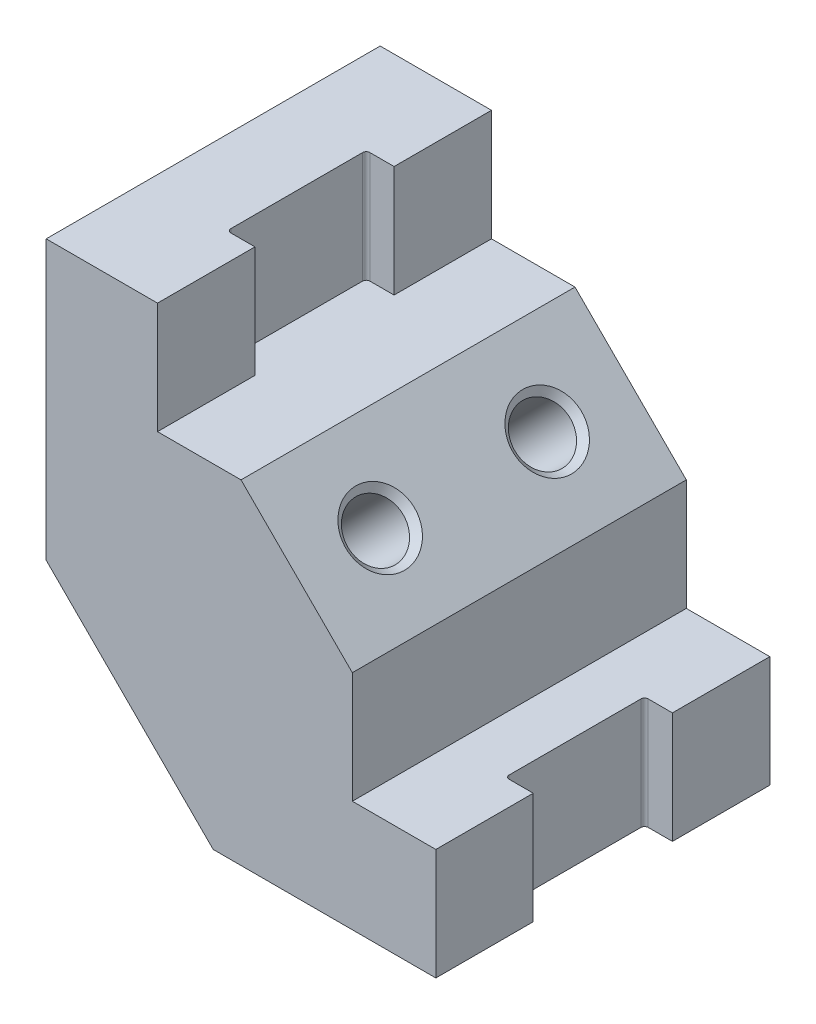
ISO-10303-21;
HEADER;
FILE_DESCRIPTION(('STEP AP214'),'2;1');
FILE_NAME('part.step','',(''),(''),'','','');
FILE_SCHEMA(('AUTOMOTIVE_DESIGN { 1 0 10303 214 1 1 1 1 }'));
ENDSEC;
DATA;
#1=APPLICATION_CONTEXT('core data for automotive mechanical design processes');
#2=APPLICATION_PROTOCOL_DEFINITION('international standard','automotive_design',2000,#1);
#3=PRODUCT_CONTEXT('',#1,'mechanical');
#4=PRODUCT('Part','Part','',(#3));
#5=PRODUCT_RELATED_PRODUCT_CATEGORY('part','',(#4));
#6=PRODUCT_DEFINITION_FORMATION('','',#4);
#7=PRODUCT_DEFINITION_CONTEXT('part definition',#1,'design');
#8=PRODUCT_DEFINITION('design','',#6,#7);
#9=PRODUCT_DEFINITION_SHAPE('','',#8);
#10=(LENGTH_UNIT() NAMED_UNIT(*) SI_UNIT(.MILLI.,.METRE.));
#11=(NAMED_UNIT(*) PLANE_ANGLE_UNIT() SI_UNIT($,.RADIAN.));
#12=(NAMED_UNIT(*) SI_UNIT($,.STERADIAN.) SOLID_ANGLE_UNIT());
#13=UNCERTAINTY_MEASURE_WITH_UNIT(LENGTH_MEASURE(1.E-05),#10,'distance_accuracy_value','');
#14=(GEOMETRIC_REPRESENTATION_CONTEXT(3) GLOBAL_UNCERTAINTY_ASSIGNED_CONTEXT((#13)) GLOBAL_UNIT_ASSIGNED_CONTEXT((#10,
#11,#12)) REPRESENTATION_CONTEXT('',''));
#15=CARTESIAN_POINT('',(0.,0.,0.));
#16=DIRECTION('',(0.,0.,1.));
#17=DIRECTION('',(1.,0.,0.));
#18=AXIS2_PLACEMENT_3D('',#15,#16,#17);
#19=CARTESIAN_POINT('',(88.9,-76.2,38.1));
#20=DIRECTION('',(-1.,0.,0.));
#21=DIRECTION('',(0.,0.,1.));
#22=AXIS2_PLACEMENT_3D('',#19,#20,#21);
#23=PLANE('',#22);
#24=DIRECTION('',(0.,0.,-1.));
#25=VECTOR('',#24,1.);
#26=CARTESIAN_POINT('',(88.9,-101.6,38.1));
#27=LINE('',#26,#25);
#28=CARTESIAN_POINT('',(88.9,-101.6,38.1));
#29=VERTEX_POINT('',#28);
#30=CARTESIAN_POINT('',(88.8999999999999,-101.6,15.875));
#31=VERTEX_POINT('',#30);
#32=EDGE_CURVE('E210',#29,#31,#27,.T.);
#33=ORIENTED_EDGE('',*,*,#32,.T.);
#34=DIRECTION('',(0.,1.,0.));
#35=VECTOR('',#34,1.);
#36=CARTESIAN_POINT('',(88.8999999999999,-101.6,15.875));
#37=LINE('',#36,#35);
#38=CARTESIAN_POINT('',(88.9,-76.2,15.875));
#39=VERTEX_POINT('',#38);
#40=EDGE_CURVE('E202',#31,#39,#37,.T.);
#41=ORIENTED_EDGE('',*,*,#40,.T.);
#42=DIRECTION('',(0.,0.,-1.));
#43=VECTOR('',#42,1.);
#44=CARTESIAN_POINT('',(88.9,-76.2,38.1));
#45=LINE('',#44,#43);
#46=CARTESIAN_POINT('',(88.9,-76.2,38.1));
#47=VERTEX_POINT('',#46);
#48=EDGE_CURVE('E211',#47,#39,#45,.T.);
#49=ORIENTED_EDGE('',*,*,#48,.F.);
#50=DIRECTION('',(0.,1.,0.));
#51=VECTOR('',#50,1.);
#52=CARTESIAN_POINT('',(88.9,-76.2,38.1));
#53=LINE('',#52,#51);
#54=EDGE_CURVE('E456',#29,#47,#53,.T.);
#55=ORIENTED_EDGE('',*,*,#54,.F.);
#56=EDGE_LOOP('',(#33,#41,#49,#55));
#57=FACE_BOUND('',#56,.T.);
#58=ADVANCED_FACE('F31',(#57),#23,.F.);
#59=CARTESIAN_POINT('',(25.4,0.,38.1));
#60=DIRECTION('',(-1.,0.,0.));
#61=DIRECTION('',(0.,-1.,0.));
#62=AXIS2_PLACEMENT_3D('',#59,#60,#61);
#63=PLANE('',#62);
#64=DIRECTION('',(0.,0.,-1.));
#65=VECTOR('',#64,1.);
#66=CARTESIAN_POINT('',(25.4,-25.4,38.1));
#67=LINE('',#66,#65);
#68=CARTESIAN_POINT('',(25.4,-25.4,38.1));
#69=VERTEX_POINT('',#68);
#70=CARTESIAN_POINT('',(25.4,-25.4,15.875));
#71=VERTEX_POINT('',#70);
#72=EDGE_CURVE('E432',#69,#71,#67,.T.);
#73=ORIENTED_EDGE('',*,*,#72,.T.);
#74=DIRECTION('',(0.,1.,0.));
#75=VECTOR('',#74,1.);
#76=CARTESIAN_POINT('',(25.4,-25.4,15.875));
#77=LINE('',#76,#75);
#78=CARTESIAN_POINT('',(25.4,0.,15.875));
#79=VERTEX_POINT('',#78);
#80=EDGE_CURVE('E445',#71,#79,#77,.T.);
#81=ORIENTED_EDGE('',*,*,#80,.T.);
#82=DIRECTION('',(0.,0.,-1.));
#83=VECTOR('',#82,1.);
#84=CARTESIAN_POINT('',(25.4,0.,38.1));
#85=LINE('',#84,#83);
#86=CARTESIAN_POINT('',(25.4,0.,38.1));
#87=VERTEX_POINT('',#86);
#88=EDGE_CURVE('E428',#87,#79,#85,.T.);
#89=ORIENTED_EDGE('',*,*,#88,.F.);
#90=DIRECTION('',(0.,1.,0.));
#91=VECTOR('',#90,1.);
#92=CARTESIAN_POINT('',(25.4,0.,38.1));
#93=LINE('',#92,#91);
#94=EDGE_CURVE('E447',#69,#87,#93,.T.);
#95=ORIENTED_EDGE('',*,*,#94,.F.);
#96=EDGE_LOOP('',(#73,#81,#89,#95));
#97=FACE_BOUND('',#96,.T.);
#98=ADVANCED_FACE('F287',(#97),#63,.F.);
#99=CARTESIAN_POINT('',(0.,-63.4999999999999,38.1));
#100=DIRECTION('',(1.,0.,0.));
#101=DIRECTION('',(0.,0.,-1.));
#102=AXIS2_PLACEMENT_3D('',#99,#100,#101);
#103=PLANE('',#102);
#104=DIRECTION('',(0.,-1.,0.));
#105=VECTOR('',#104,1.);
#106=CARTESIAN_POINT('',(0.,-63.4999999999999,-38.1));
#107=LINE('',#106,#105);
#108=CARTESIAN_POINT('',(0.,0.,-38.1));
#109=VERTEX_POINT('',#108);
#110=CARTESIAN_POINT('',(0.,-63.4999999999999,-38.1));
#111=VERTEX_POINT('',#110);
#112=EDGE_CURVE('E442',#109,#111,#107,.T.);
#113=ORIENTED_EDGE('',*,*,#112,.T.);
#114=DIRECTION('',(0.,0.,-1.));
#115=VECTOR('',#114,1.);
#116=CARTESIAN_POINT('',(0.,-63.4999999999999,38.1));
#117=LINE('',#116,#115);
#118=CARTESIAN_POINT('',(0.,-63.4999999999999,38.1));
#119=VERTEX_POINT('',#118);
#120=EDGE_CURVE('E220',#119,#111,#117,.T.);
#121=ORIENTED_EDGE('',*,*,#120,.F.);
#122=DIRECTION('',(0.,-1.,0.));
#123=VECTOR('',#122,1.);
#124=CARTESIAN_POINT('',(0.,-63.4999999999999,38.1));
#125=LINE('',#124,#123);
#126=CARTESIAN_POINT('',(0.,0.,38.1));
#127=VERTEX_POINT('',#126);
#128=EDGE_CURVE('E422',#127,#119,#125,.T.);
#129=ORIENTED_EDGE('',*,*,#128,.F.);
#130=DIRECTION('',(0.,0.,-1.));
#131=VECTOR('',#130,1.);
#132=CARTESIAN_POINT('',(0.,0.,38.1));
#133=LINE('',#132,#131);
#134=EDGE_CURVE('E423',#127,#109,#133,.T.);
#135=ORIENTED_EDGE('',*,*,#134,.T.);
#136=EDGE_LOOP('',(#113,#121,#129,#135));
#137=FACE_BOUND('',#136,.T.);
#138=ADVANCED_FACE('F293',(#137),#103,.F.);
#139=CARTESIAN_POINT('',(38.1,-101.6,38.1));
#140=DIRECTION('',(0.707106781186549,0.707106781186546,0.));
#141=DIRECTION('',(-0.707106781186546,0.707106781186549,0.));
#142=AXIS2_PLACEMENT_3D('',#139,#140,#141);
#143=PLANE('',#142);
#144=CARTESIAN_POINT('',(15.8769178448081,-79.3769178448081,-19.05));
#145=DIRECTION('',(0.707106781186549,0.707106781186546,0.));
#146=DIRECTION('',(-0.707106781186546,0.707106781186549,0.));
#147=AXIS2_PLACEMENT_3D('',#144,#145,#146);
#148=CIRCLE('',#147,7.87400000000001);
#149=CARTESIAN_POINT('',(10.3091590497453,-73.8091590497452,-19.05));
#150=VERTEX_POINT('',#149);
#151=EDGE_CURVE('E258',#150,#150,#148,.T.);
#152=ORIENTED_EDGE('',*,*,#151,.T.);
#153=EDGE_LOOP('',(#152));
#154=FACE_BOUND('',#153,.T.);
#155=CARTESIAN_POINT('',(15.8769178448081,-79.3769178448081,19.05));
#156=DIRECTION('',(0.707106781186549,0.707106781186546,0.));
#157=DIRECTION('',(-0.707106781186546,0.707106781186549,0.));
#158=AXIS2_PLACEMENT_3D('',#155,#156,#157);
#159=CIRCLE('',#158,7.87399999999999);
#160=CARTESIAN_POINT('',(21.444676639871,-84.944676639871,19.05));
#161=VERTEX_POINT('',#160);
#162=EDGE_CURVE('E255',#161,#161,#159,.T.);
#163=ORIENTED_EDGE('',*,*,#162,.T.);
#164=EDGE_LOOP('',(#163));
#165=FACE_BOUND('',#164,.T.);
#166=DIRECTION('',(0.707106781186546,-0.707106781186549,0.));
#167=VECTOR('',#166,1.);
#168=CARTESIAN_POINT('',(38.1,-101.6,-38.1));
#169=LINE('',#168,#167);
#170=CARTESIAN_POINT('',(38.1,-101.6,-38.1));
#171=VERTEX_POINT('',#170);
#172=EDGE_CURVE('E440',#111,#171,#169,.T.);
#173=ORIENTED_EDGE('',*,*,#172,.T.);
#174=DIRECTION('',(0.,0.,-1.));
#175=VECTOR('',#174,1.);
#176=CARTESIAN_POINT('',(38.1,-101.6,38.1));
#177=LINE('',#176,#175);
#178=CARTESIAN_POINT('',(38.1,-101.6,38.1));
#179=VERTEX_POINT('',#178);
#180=EDGE_CURVE('E214',#179,#171,#177,.T.);
#181=ORIENTED_EDGE('',*,*,#180,.F.);
#182=DIRECTION('',(0.707106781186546,-0.707106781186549,0.));
#183=VECTOR('',#182,1.);
#184=CARTESIAN_POINT('',(38.1,-101.6,38.1));
#185=LINE('',#184,#183);
#186=EDGE_CURVE('E460',#119,#179,#185,.T.);
#187=ORIENTED_EDGE('',*,*,#186,.F.);
#188=ORIENTED_EDGE('',*,*,#120,.T.);
#189=EDGE_LOOP('',(#173,#181,#187,#188));
#190=FACE_BOUND('',#189,.T.);
#191=ADVANCED_FACE('F307',(#154,#165,#190),#143,.F.);
#192=CARTESIAN_POINT('',(88.9,-101.6,38.1));
#193=DIRECTION('',(0.,1.,0.));
#194=DIRECTION('',(0.,0.,1.));
#195=AXIS2_PLACEMENT_3D('',#192,#193,#194);
#196=PLANE('',#195);
#197=DIRECTION('',(-1.,0.,0.));
#198=VECTOR('',#197,1.);
#199=CARTESIAN_POINT('',(88.8999999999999,-101.6,-15.875));
#200=LINE('',#199,#198);
#201=CARTESIAN_POINT('',(88.8999999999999,-101.6,-15.875));
#202=VERTEX_POINT('',#201);
#203=CARTESIAN_POINT('',(83.3881999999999,-101.6,-15.875));
#204=VERTEX_POINT('',#203);
#205=EDGE_CURVE('E181',#202,#204,#200,.T.);
#206=ORIENTED_EDGE('',*,*,#205,.T.);
#207=CARTESIAN_POINT('',(83.3881999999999,-101.6,-15.0368));
#208=DIRECTION('',(0.,1.,0.));
#209=DIRECTION('',(0.,0.,1.));
#210=AXIS2_PLACEMENT_3D('',#207,#208,#209);
#211=CIRCLE('',#210,0.8382);
#212=CARTESIAN_POINT('',(82.5499999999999,-101.6,-15.0368));
#213=VERTEX_POINT('',#212);
#214=EDGE_CURVE('E246',#204,#213,#211,.T.);
#215=ORIENTED_EDGE('',*,*,#214,.T.);
#216=DIRECTION('',(0.,0.,1.));
#217=VECTOR('',#216,1.);
#218=CARTESIAN_POINT('',(82.5499999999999,-101.6,15.875));
#219=LINE('',#218,#217);
#220=CARTESIAN_POINT('',(82.5499999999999,-101.6,15.0368));
#221=VERTEX_POINT('',#220);
#222=EDGE_CURVE('E192',#213,#221,#219,.T.);
#223=ORIENTED_EDGE('',*,*,#222,.T.);
#224=CARTESIAN_POINT('',(83.3881999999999,-101.6,15.0368));
#225=DIRECTION('',(0.,1.,0.));
#226=DIRECTION('',(0.,0.,1.));
#227=AXIS2_PLACEMENT_3D('',#224,#225,#226);
#228=CIRCLE('',#227,0.8382);
#229=CARTESIAN_POINT('',(83.3881999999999,-101.6,15.875));
#230=VERTEX_POINT('',#229);
#231=EDGE_CURVE('E250',#221,#230,#228,.T.);
#232=ORIENTED_EDGE('',*,*,#231,.T.);
#233=DIRECTION('',(1.,0.,0.));
#234=VECTOR('',#233,1.);
#235=CARTESIAN_POINT('',(88.8999999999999,-101.6,15.875));
#236=LINE('',#235,#234);
#237=EDGE_CURVE('E203',#230,#31,#236,.T.);
#238=ORIENTED_EDGE('',*,*,#237,.T.);
#239=ORIENTED_EDGE('',*,*,#32,.F.);
#240=DIRECTION('',(1.,0.,0.));
#241=VECTOR('',#240,1.);
#242=CARTESIAN_POINT('',(88.9,-101.6,38.1));
#243=LINE('',#242,#241);
#244=EDGE_CURVE('E458',#179,#29,#243,.T.);
#245=ORIENTED_EDGE('',*,*,#244,.F.);
#246=ORIENTED_EDGE('',*,*,#180,.T.);
#247=DIRECTION('',(1.,0.,0.));
#248=VECTOR('',#247,1.);
#249=CARTESIAN_POINT('',(88.9,-101.6,-38.1));
#250=LINE('',#249,#248);
#251=CARTESIAN_POINT('',(88.9,-101.6,-38.1));
#252=VERTEX_POINT('',#251);
#253=EDGE_CURVE('E208',#171,#252,#250,.T.);
#254=ORIENTED_EDGE('',*,*,#253,.T.);
#255=EDGE_CURVE('E199',#202,#252,#27,.T.);
#256=ORIENTED_EDGE('',*,*,#255,.F.);
#257=EDGE_LOOP('',(#206,#215,#223,#232,#238,#239,#245,#246,#254,#256));
#258=FACE_BOUND('',#257,.T.);
#259=ADVANCED_FACE('F205',(#258),#196,.F.);
#260=CARTESIAN_POINT('',(88.9,-76.2,-15.875));
#261=VERTEX_POINT('',#260);
#262=CARTESIAN_POINT('',(88.9,-76.2,-38.1));
#263=VERTEX_POINT('',#262);
#264=EDGE_CURVE('E201',#261,#263,#45,.T.);
#265=ORIENTED_EDGE('',*,*,#264,.F.);
#266=DIRECTION('',(0.,1.,0.));
#267=VECTOR('',#266,1.);
#268=CARTESIAN_POINT('',(88.8999999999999,-101.6,-15.875));
#269=LINE('',#268,#267);
#270=EDGE_CURVE('E185',#202,#261,#269,.T.);
#271=ORIENTED_EDGE('',*,*,#270,.F.);
#272=ORIENTED_EDGE('',*,*,#255,.T.);
#273=DIRECTION('',(0.,1.,0.));
#274=VECTOR('',#273,1.);
#275=CARTESIAN_POINT('',(88.9,-76.2,-38.1));
#276=LINE('',#275,#274);
#277=EDGE_CURVE('E436',#252,#263,#276,.T.);
#278=ORIENTED_EDGE('',*,*,#277,.T.);
#279=EDGE_LOOP('',(#265,#271,#272,#278));
#280=FACE_BOUND('',#279,.T.);
#281=ADVANCED_FACE('F197',(#280),#23,.F.);
#282=CARTESIAN_POINT('',(69.8499999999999,-76.2,38.1));
#283=DIRECTION('',(0.,-1.,0.));
#284=DIRECTION('',(1.,0.,0.));
#285=AXIS2_PLACEMENT_3D('',#282,#283,#284);
#286=PLANE('',#285);
#287=ORIENTED_EDGE('',*,*,#48,.T.);
#288=DIRECTION('',(1.,0.,0.));
#289=VECTOR('',#288,1.);
#290=CARTESIAN_POINT('',(88.9,-76.2,15.875));
#291=LINE('',#290,#289);
#292=CARTESIAN_POINT('',(83.3882,-76.2,15.875));
#293=VERTEX_POINT('',#292);
#294=EDGE_CURVE('E193',#293,#39,#291,.T.);
#295=ORIENTED_EDGE('',*,*,#294,.F.);
#296=CARTESIAN_POINT('',(83.3882,-76.2,15.0368));
#297=DIRECTION('',(0.,-1.,0.));
#298=DIRECTION('',(1.,0.,0.));
#299=AXIS2_PLACEMENT_3D('',#296,#297,#298);
#300=CIRCLE('',#299,0.8382);
#301=CARTESIAN_POINT('',(82.55,-76.2,15.0368));
#302=VERTEX_POINT('',#301);
#303=EDGE_CURVE('E248',#293,#302,#300,.T.);
#304=ORIENTED_EDGE('',*,*,#303,.T.);
#305=DIRECTION('',(0.,0.,1.));
#306=VECTOR('',#305,1.);
#307=CARTESIAN_POINT('',(82.55,-76.2,15.875));
#308=LINE('',#307,#306);
#309=CARTESIAN_POINT('',(82.55,-76.2,-15.0368));
#310=VERTEX_POINT('',#309);
#311=EDGE_CURVE('E486',#310,#302,#308,.T.);
#312=ORIENTED_EDGE('',*,*,#311,.F.);
#313=CARTESIAN_POINT('',(83.3882,-76.2,-15.0368));
#314=DIRECTION('',(0.,-1.,0.));
#315=DIRECTION('',(1.,0.,0.));
#316=AXIS2_PLACEMENT_3D('',#313,#314,#315);
#317=CIRCLE('',#316,0.8382);
#318=CARTESIAN_POINT('',(83.3882,-76.2,-15.875));
#319=VERTEX_POINT('',#318);
#320=EDGE_CURVE('E244',#310,#319,#317,.T.);
#321=ORIENTED_EDGE('',*,*,#320,.T.);
#322=DIRECTION('',(-1.,0.,0.));
#323=VECTOR('',#322,1.);
#324=CARTESIAN_POINT('',(88.9,-76.2,-15.875));
#325=LINE('',#324,#323);
#326=EDGE_CURVE('E435',#261,#319,#325,.T.);
#327=ORIENTED_EDGE('',*,*,#326,.F.);
#328=ORIENTED_EDGE('',*,*,#264,.T.);
#329=DIRECTION('',(-1.,0.,0.));
#330=VECTOR('',#329,1.);
#331=CARTESIAN_POINT('',(69.8499999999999,-76.2,-38.1));
#332=LINE('',#331,#330);
#333=CARTESIAN_POINT('',(69.8499999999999,-76.2,-38.1));
#334=VERTEX_POINT('',#333);
#335=EDGE_CURVE('E400',#263,#334,#332,.T.);
#336=ORIENTED_EDGE('',*,*,#335,.T.);
#337=DIRECTION('',(0.,0.,-1.));
#338=VECTOR('',#337,1.);
#339=CARTESIAN_POINT('',(69.8499999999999,-76.2,38.1));
#340=LINE('',#339,#338);
#341=CARTESIAN_POINT('',(69.8499999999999,-76.2,38.1));
#342=VERTEX_POINT('',#341);
#343=EDGE_CURVE('E396',#342,#334,#340,.T.);
#344=ORIENTED_EDGE('',*,*,#343,.F.);
#345=DIRECTION('',(-1.,0.,0.));
#346=VECTOR('',#345,1.);
#347=CARTESIAN_POINT('',(69.8499999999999,-76.2,38.1));
#348=LINE('',#347,#346);
#349=EDGE_CURVE('E454',#47,#342,#348,.T.);
#350=ORIENTED_EDGE('',*,*,#349,.F.);
#351=EDGE_LOOP('',(#287,#295,#304,#312,#321,#327,#328,#336,#344,#350));
#352=FACE_BOUND('',#351,.T.);
#353=ADVANCED_FACE('F300',(#352),#286,.F.);
#354=CARTESIAN_POINT('',(69.8499999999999,-50.8,38.1));
#355=DIRECTION('',(-1.,0.,0.));
#356=DIRECTION('',(0.,0.,1.));
#357=AXIS2_PLACEMENT_3D('',#354,#355,#356);
#358=PLANE('',#357);
#359=DIRECTION('',(0.,1.,0.));
#360=VECTOR('',#359,1.);
#361=CARTESIAN_POINT('',(69.8499999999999,-50.8,-38.1));
#362=LINE('',#361,#360);
#363=CARTESIAN_POINT('',(69.8499999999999,-50.8,-38.1));
#364=VERTEX_POINT('',#363);
#365=EDGE_CURVE('E390',#334,#364,#362,.T.);
#366=ORIENTED_EDGE('',*,*,#365,.T.);
#367=DIRECTION('',(0.,0.,-1.));
#368=VECTOR('',#367,1.);
#369=CARTESIAN_POINT('',(69.8499999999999,-50.8,38.1));
#370=LINE('',#369,#368);
#371=CARTESIAN_POINT('',(69.8499999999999,-50.8,38.1));
#372=VERTEX_POINT('',#371);
#373=EDGE_CURVE('E393',#372,#364,#370,.T.);
#374=ORIENTED_EDGE('',*,*,#373,.F.);
#375=DIRECTION('',(0.,1.,0.));
#376=VECTOR('',#375,1.);
#377=CARTESIAN_POINT('',(69.8499999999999,-50.8,38.1));
#378=LINE('',#377,#376);
#379=EDGE_CURVE('E452',#342,#372,#378,.T.);
#380=ORIENTED_EDGE('',*,*,#379,.F.);
#381=ORIENTED_EDGE('',*,*,#343,.T.);
#382=EDGE_LOOP('',(#366,#374,#380,#381));
#383=FACE_BOUND('',#382,.T.);
#384=ADVANCED_FACE('F305',(#383),#358,.F.);
#385=CARTESIAN_POINT('',(44.45,-25.4,38.1));
#386=DIRECTION('',(-0.707106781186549,-0.707106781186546,0.));
#387=DIRECTION('',(0.707106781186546,-0.707106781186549,0.));
#388=AXIS2_PLACEMENT_3D('',#385,#386,#387);
#389=PLANE('',#388);
#390=CARTESIAN_POINT('',(57.1519178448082,-38.1019178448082,-19.05));
#391=DIRECTION('',(-0.707106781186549,-0.707106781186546,0.));
#392=DIRECTION('',(0.707106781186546,-0.707106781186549,0.));
#393=AXIS2_PLACEMENT_3D('',#390,#391,#392);
#394=CIRCLE('',#393,7.87399999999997);
#395=CARTESIAN_POINT('',(62.719676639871,-43.6696766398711,-19.05));
#396=VERTEX_POINT('',#395);
#397=EDGE_CURVE('E270',#396,#396,#394,.T.);
#398=ORIENTED_EDGE('',*,*,#397,.T.);
#399=EDGE_LOOP('',(#398));
#400=FACE_BOUND('',#399,.T.);
#401=CARTESIAN_POINT('',(57.1519178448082,-38.1019178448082,19.05));
#402=DIRECTION('',(-0.707106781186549,-0.707106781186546,0.));
#403=DIRECTION('',(0.707106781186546,-0.707106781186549,0.));
#404=AXIS2_PLACEMENT_3D('',#401,#402,#403);
#405=CIRCLE('',#404,7.87399999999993);
#406=CARTESIAN_POINT('',(62.719676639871,-43.669676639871,19.05));
#407=VERTEX_POINT('',#406);
#408=EDGE_CURVE('E267',#407,#407,#405,.T.);
#409=ORIENTED_EDGE('',*,*,#408,.T.);
#410=EDGE_LOOP('',(#409));
#411=FACE_BOUND('',#410,.T.);
#412=DIRECTION('',(-0.707106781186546,0.707106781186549,0.));
#413=VECTOR('',#412,1.);
#414=CARTESIAN_POINT('',(44.45,-25.4,-38.1));
#415=LINE('',#414,#413);
#416=CARTESIAN_POINT('',(44.45,-25.4,-38.1));
#417=VERTEX_POINT('',#416);
#418=EDGE_CURVE('E399',#364,#417,#415,.T.);
#419=ORIENTED_EDGE('',*,*,#418,.T.);
#420=DIRECTION('',(0.,0.,-1.));
#421=VECTOR('',#420,1.);
#422=CARTESIAN_POINT('',(44.45,-25.4,38.1));
#423=LINE('',#422,#421);
#424=CARTESIAN_POINT('',(44.45,-25.4,38.1));
#425=VERTEX_POINT('',#424);
#426=EDGE_CURVE('E406',#425,#417,#423,.T.);
#427=ORIENTED_EDGE('',*,*,#426,.F.);
#428=DIRECTION('',(-0.707106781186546,0.707106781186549,0.));
#429=VECTOR('',#428,1.);
#430=CARTESIAN_POINT('',(44.45,-25.4,38.1));
#431=LINE('',#430,#429);
#432=EDGE_CURVE('E405',#372,#425,#431,.T.);
#433=ORIENTED_EDGE('',*,*,#432,.F.);
#434=ORIENTED_EDGE('',*,*,#373,.T.);
#435=EDGE_LOOP('',(#419,#427,#433,#434));
#436=FACE_BOUND('',#435,.T.);
#437=ADVANCED_FACE('F379',(#400,#411,#436),#389,.F.);
#438=CARTESIAN_POINT('',(25.4,-25.4,38.1));
#439=DIRECTION('',(0.,-1.,0.));
#440=DIRECTION('',(0.,0.,-1.));
#441=AXIS2_PLACEMENT_3D('',#438,#439,#440);
#442=PLANE('',#441);
#443=DIRECTION('',(-1.,0.,0.));
#444=VECTOR('',#443,1.);
#445=CARTESIAN_POINT('',(25.4,-25.4,-15.875));
#446=LINE('',#445,#444);
#447=CARTESIAN_POINT('',(25.4,-25.4,-15.875));
#448=VERTEX_POINT('',#447);
#449=CARTESIAN_POINT('',(19.8882,-25.4,-15.875));
#450=VERTEX_POINT('',#449);
#451=EDGE_CURVE('E471',#448,#450,#446,.T.);
#452=ORIENTED_EDGE('',*,*,#451,.T.);
#453=CARTESIAN_POINT('',(19.8882,-25.4,-15.0368));
#454=DIRECTION('',(0.,-1.,0.));
#455=DIRECTION('',(0.,0.,-1.));
#456=AXIS2_PLACEMENT_3D('',#453,#454,#455);
#457=CIRCLE('',#456,0.8382);
#458=CARTESIAN_POINT('',(19.05,-25.4,-15.0368));
#459=VERTEX_POINT('',#458);
#460=EDGE_CURVE('E240',#450,#459,#457,.F.);
#461=ORIENTED_EDGE('',*,*,#460,.T.);
#462=DIRECTION('',(0.,0.,1.));
#463=VECTOR('',#462,1.);
#464=CARTESIAN_POINT('',(19.05,-25.4,15.875));
#465=LINE('',#464,#463);
#466=CARTESIAN_POINT('',(19.05,-25.4,15.0368));
#467=VERTEX_POINT('',#466);
#468=EDGE_CURVE('E479',#459,#467,#465,.T.);
#469=ORIENTED_EDGE('',*,*,#468,.T.);
#470=CARTESIAN_POINT('',(19.8882,-25.4,15.0368));
#471=DIRECTION('',(0.,-1.,0.));
#472=DIRECTION('',(0.,0.,-1.));
#473=AXIS2_PLACEMENT_3D('',#470,#471,#472);
#474=CIRCLE('',#473,0.8382);
#475=CARTESIAN_POINT('',(19.8882,-25.4,15.875));
#476=VERTEX_POINT('',#475);
#477=EDGE_CURVE('E54',#467,#476,#474,.F.);
#478=ORIENTED_EDGE('',*,*,#477,.T.);
#479=DIRECTION('',(1.,0.,0.));
#480=VECTOR('',#479,1.);
#481=CARTESIAN_POINT('',(25.4,-25.4,15.875));
#482=LINE('',#481,#480);
#483=EDGE_CURVE('E466',#476,#71,#482,.T.);
#484=ORIENTED_EDGE('',*,*,#483,.T.);
#485=ORIENTED_EDGE('',*,*,#72,.F.);
#486=DIRECTION('',(-1.,0.,0.));
#487=VECTOR('',#486,1.);
#488=CARTESIAN_POINT('',(25.4,-25.4,38.1));
#489=LINE('',#488,#487);
#490=EDGE_CURVE('E449',#425,#69,#489,.T.);
#491=ORIENTED_EDGE('',*,*,#490,.F.);
#492=ORIENTED_EDGE('',*,*,#426,.T.);
#493=DIRECTION('',(-1.,0.,0.));
#494=VECTOR('',#493,1.);
#495=CARTESIAN_POINT('',(25.4,-25.4,-38.1));
#496=LINE('',#495,#494);
#497=CARTESIAN_POINT('',(25.4,-25.4,-38.1));
#498=VERTEX_POINT('',#497);
#499=EDGE_CURVE('E412',#417,#498,#496,.T.);
#500=ORIENTED_EDGE('',*,*,#499,.T.);
#501=EDGE_CURVE('E431',#448,#498,#67,.T.);
#502=ORIENTED_EDGE('',*,*,#501,.F.);
#503=EDGE_LOOP('',(#452,#461,#469,#478,#484,#485,#491,#492,#500,#502));
#504=FACE_BOUND('',#503,.T.);
#505=ADVANCED_FACE('F375',(#504),#442,.F.);
#506=CARTESIAN_POINT('',(25.4,0.,-15.875));
#507=VERTEX_POINT('',#506);
#508=CARTESIAN_POINT('',(25.4,0.,-38.1));
#509=VERTEX_POINT('',#508);
#510=EDGE_CURVE('E426',#507,#509,#85,.T.);
#511=ORIENTED_EDGE('',*,*,#510,.F.);
#512=DIRECTION('',(0.,1.,0.));
#513=VECTOR('',#512,1.);
#514=CARTESIAN_POINT('',(25.4,-25.4,-15.875));
#515=LINE('',#514,#513);
#516=EDGE_CURVE('E464',#448,#507,#515,.T.);
#517=ORIENTED_EDGE('',*,*,#516,.F.);
#518=ORIENTED_EDGE('',*,*,#501,.T.);
#519=DIRECTION('',(0.,1.,0.));
#520=VECTOR('',#519,1.);
#521=CARTESIAN_POINT('',(25.4,0.,-38.1));
#522=LINE('',#521,#520);
#523=EDGE_CURVE('E414',#498,#509,#522,.T.);
#524=ORIENTED_EDGE('',*,*,#523,.T.);
#525=EDGE_LOOP('',(#511,#517,#518,#524));
#526=FACE_BOUND('',#525,.T.);
#527=ADVANCED_FACE('F296',(#526),#63,.F.);
#528=CARTESIAN_POINT('',(0.,0.,38.1));
#529=DIRECTION('',(0.,-1.,0.));
#530=DIRECTION('',(0.,0.,-1.));
#531=AXIS2_PLACEMENT_3D('',#528,#529,#530);
#532=PLANE('',#531);
#533=ORIENTED_EDGE('',*,*,#88,.T.);
#534=DIRECTION('',(1.,0.,0.));
#535=VECTOR('',#534,1.);
#536=CARTESIAN_POINT('',(25.4,0.,15.875));
#537=LINE('',#536,#535);
#538=CARTESIAN_POINT('',(19.8882,0.,15.875));
#539=VERTEX_POINT('',#538);
#540=EDGE_CURVE('E469',#539,#79,#537,.T.);
#541=ORIENTED_EDGE('',*,*,#540,.F.);
#542=CARTESIAN_POINT('',(19.8882,0.,15.0368));
#543=DIRECTION('',(0.,-1.,0.));
#544=DIRECTION('',(0.,0.,-1.));
#545=AXIS2_PLACEMENT_3D('',#542,#543,#544);
#546=CIRCLE('',#545,0.8382);
#547=CARTESIAN_POINT('',(19.05,0.,15.0368));
#548=VERTEX_POINT('',#547);
#549=EDGE_CURVE('E46',#539,#548,#546,.T.);
#550=ORIENTED_EDGE('',*,*,#549,.T.);
#551=DIRECTION('',(0.,0.,1.));
#552=VECTOR('',#551,1.);
#553=CARTESIAN_POINT('',(19.05,0.,15.875));
#554=LINE('',#553,#552);
#555=CARTESIAN_POINT('',(19.05,0.,-15.0368));
#556=VERTEX_POINT('',#555);
#557=EDGE_CURVE('E472',#556,#548,#554,.T.);
#558=ORIENTED_EDGE('',*,*,#557,.F.);
#559=CARTESIAN_POINT('',(19.8882,0.,-15.0368));
#560=DIRECTION('',(0.,-1.,0.));
#561=DIRECTION('',(0.,0.,-1.));
#562=AXIS2_PLACEMENT_3D('',#559,#560,#561);
#563=CIRCLE('',#562,0.8382);
#564=CARTESIAN_POINT('',(19.8882,0.,-15.875));
#565=VERTEX_POINT('',#564);
#566=EDGE_CURVE('E252',#556,#565,#563,.T.);
#567=ORIENTED_EDGE('',*,*,#566,.T.);
#568=DIRECTION('',(-1.,0.,0.));
#569=VECTOR('',#568,1.);
#570=CARTESIAN_POINT('',(25.4,0.,-15.875));
#571=LINE('',#570,#569);
#572=EDGE_CURVE('E475',#507,#565,#571,.T.);
#573=ORIENTED_EDGE('',*,*,#572,.F.);
#574=ORIENTED_EDGE('',*,*,#510,.T.);
#575=DIRECTION('',(-1.,0.,0.));
#576=VECTOR('',#575,1.);
#577=CARTESIAN_POINT('',(0.,0.,-38.1));
#578=LINE('',#577,#576);
#579=EDGE_CURVE('E420',#509,#109,#578,.T.);
#580=ORIENTED_EDGE('',*,*,#579,.T.);
#581=ORIENTED_EDGE('',*,*,#134,.F.);
#582=DIRECTION('',(-1.,0.,0.));
#583=VECTOR('',#582,1.);
#584=CARTESIAN_POINT('',(0.,0.,38.1));
#585=LINE('',#584,#583);
#586=EDGE_CURVE('E427',#87,#127,#585,.T.);
#587=ORIENTED_EDGE('',*,*,#586,.F.);
#588=EDGE_LOOP('',(#533,#541,#550,#558,#567,#573,#574,#580,#581,#587));
#589=FACE_BOUND('',#588,.T.);
#590=ADVANCED_FACE('F366',(#589),#532,.F.);
#591=CARTESIAN_POINT('',(0.,0.,38.1));
#592=DIRECTION('',(0.,0.,-1.));
#593=DIRECTION('',(-1.,0.,0.));
#594=AXIS2_PLACEMENT_3D('',#591,#592,#593);
#595=PLANE('',#594);
#596=ORIENTED_EDGE('',*,*,#128,.T.);
#597=ORIENTED_EDGE('',*,*,#186,.T.);
#598=ORIENTED_EDGE('',*,*,#244,.T.);
#599=ORIENTED_EDGE('',*,*,#54,.T.);
#600=ORIENTED_EDGE('',*,*,#349,.T.);
#601=ORIENTED_EDGE('',*,*,#379,.T.);
#602=ORIENTED_EDGE('',*,*,#432,.T.);
#603=ORIENTED_EDGE('',*,*,#490,.T.);
#604=ORIENTED_EDGE('',*,*,#94,.T.);
#605=ORIENTED_EDGE('',*,*,#586,.T.);
#606=EDGE_LOOP('',(#596,#597,#598,#599,#600,#601,#602,#603,#604,#605));
#607=FACE_BOUND('',#606,.T.);
#608=ADVANCED_FACE('F363',(#607),#595,.F.);
#609=CARTESIAN_POINT('',(0.,0.,-38.1));
#610=DIRECTION('',(0.,0.,-1.));
#611=DIRECTION('',(-1.,0.,0.));
#612=AXIS2_PLACEMENT_3D('',#609,#610,#611);
#613=PLANE('',#612);
#614=ORIENTED_EDGE('',*,*,#112,.F.);
#615=ORIENTED_EDGE('',*,*,#579,.F.);
#616=ORIENTED_EDGE('',*,*,#523,.F.);
#617=ORIENTED_EDGE('',*,*,#499,.F.);
#618=ORIENTED_EDGE('',*,*,#418,.F.);
#619=ORIENTED_EDGE('',*,*,#365,.F.);
#620=ORIENTED_EDGE('',*,*,#335,.F.);
#621=ORIENTED_EDGE('',*,*,#277,.F.);
#622=ORIENTED_EDGE('',*,*,#253,.F.);
#623=ORIENTED_EDGE('',*,*,#172,.F.);
#624=EDGE_LOOP('',(#614,#615,#616,#617,#618,#619,#620,#621,#622,#623));
#625=FACE_BOUND('',#624,.T.);
#626=ADVANCED_FACE('F356',(#625),#613,.T.);
#627=CARTESIAN_POINT('',(-3.17308215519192,-98.4269178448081,19.05));
#628=DIRECTION('',(0.707106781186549,0.707106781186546,0.));
#629=DIRECTION('',(-0.707106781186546,0.707106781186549,0.));
#630=AXIS2_PLACEMENT_3D('',#627,#628,#629);
#631=CYLINDRICAL_SURFACE('',#630,6.35);
#632=CARTESIAN_POINT('',(16.9545485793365,-78.2992871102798,19.05));
#633=DIRECTION('',(0.707106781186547,0.707106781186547,0.));
#634=DIRECTION('',(-0.707106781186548,0.707106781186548,0.));
#635=AXIS2_PLACEMENT_3D('',#632,#633,#634);
#636=CIRCLE('',#635,6.35);
#637=CARTESIAN_POINT('',(21.444676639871,-82.7894151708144,19.05));
#638=VERTEX_POINT('',#637);
#639=EDGE_CURVE('E11',#638,#638,#636,.F.);
#640=ORIENTED_EDGE('',*,*,#639,.T.);
#641=EDGE_LOOP('',(#640));
#642=FACE_BOUND('',#641,.T.);
#643=CARTESIAN_POINT('',(56.0742871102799,-39.1795485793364,19.05));
#644=DIRECTION('',(-0.70710678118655,-0.707106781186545,0.));
#645=DIRECTION('',(0.707106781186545,-0.70710678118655,0.));
#646=AXIS2_PLACEMENT_3D('',#643,#644,#645);
#647=CIRCLE('',#646,6.35);
#648=CARTESIAN_POINT('',(60.5644151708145,-43.669676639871,19.05));
#649=VERTEX_POINT('',#648);
#650=EDGE_CURVE('E39',#649,#649,#647,.F.);
#651=ORIENTED_EDGE('',*,*,#650,.T.);
#652=EDGE_LOOP('',(#651));
#653=FACE_BOUND('',#652,.T.);
#654=ADVANCED_FACE('F275',(#642,#653),#631,.F.);
#655=CARTESIAN_POINT('',(-3.17308215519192,-98.4269178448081,-19.05));
#656=DIRECTION('',(0.707106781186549,0.707106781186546,0.));
#657=DIRECTION('',(-0.707106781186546,0.707106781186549,0.));
#658=AXIS2_PLACEMENT_3D('',#655,#656,#657);
#659=CYLINDRICAL_SURFACE('',#658,6.35);
#660=CARTESIAN_POINT('',(16.9545485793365,-78.2992871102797,-19.05));
#661=DIRECTION('',(0.707106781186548,0.707106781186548,0.));
#662=DIRECTION('',(-0.707106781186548,0.707106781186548,0.));
#663=AXIS2_PLACEMENT_3D('',#660,#661,#662);
#664=CIRCLE('',#663,6.35);
#665=CARTESIAN_POINT('',(12.4644205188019,-73.8091590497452,-19.05));
#666=VERTEX_POINT('',#665);
#667=EDGE_CURVE('E264',#666,#666,#664,.F.);
#668=ORIENTED_EDGE('',*,*,#667,.T.);
#669=EDGE_LOOP('',(#668));
#670=FACE_BOUND('',#669,.T.);
#671=CARTESIAN_POINT('',(56.0742871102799,-39.1795485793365,-19.05));
#672=DIRECTION('',(-0.707106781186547,-0.707106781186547,0.));
#673=DIRECTION('',(0.707106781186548,-0.707106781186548,0.));
#674=AXIS2_PLACEMENT_3D('',#671,#672,#673);
#675=CIRCLE('',#674,6.35);
#676=CARTESIAN_POINT('',(60.5644151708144,-43.669676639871,-19.05));
#677=VERTEX_POINT('',#676);
#678=EDGE_CURVE('E261',#677,#677,#675,.F.);
#679=ORIENTED_EDGE('',*,*,#678,.T.);
#680=EDGE_LOOP('',(#679));
#681=FACE_BOUND('',#680,.T.);
#682=ADVANCED_FACE('F344',(#670,#681),#659,.F.);
#683=CARTESIAN_POINT('',(25.4,-25.4,15.875));
#684=DIRECTION('',(0.,0.,1.));
#685=DIRECTION('',(1.,0.,0.));
#686=AXIS2_PLACEMENT_3D('',#683,#684,#685);
#687=PLANE('',#686);
#688=ORIENTED_EDGE('',*,*,#483,.F.);
#689=DIRECTION('',(0.,1.,0.));
#690=VECTOR('',#689,1.);
#691=CARTESIAN_POINT('',(19.8882,0.,15.875));
#692=LINE('',#691,#690);
#693=EDGE_CURVE('E242',#476,#539,#692,.T.);
#694=ORIENTED_EDGE('',*,*,#693,.T.);
#695=ORIENTED_EDGE('',*,*,#540,.T.);
#696=ORIENTED_EDGE('',*,*,#80,.F.);
#697=EDGE_LOOP('',(#688,#694,#695,#696));
#698=FACE_BOUND('',#697,.T.);
#699=ADVANCED_FACE('F346',(#698),#687,.F.);
#700=CARTESIAN_POINT('',(19.05,-25.4,15.875));
#701=DIRECTION('',(-1.,0.,0.));
#702=DIRECTION('',(0.,0.,1.));
#703=AXIS2_PLACEMENT_3D('',#700,#701,#702);
#704=PLANE('',#703);
#705=ORIENTED_EDGE('',*,*,#468,.F.);
#706=DIRECTION('',(0.,1.,0.));
#707=VECTOR('',#706,1.);
#708=CARTESIAN_POINT('',(19.05,0.,-15.0368));
#709=LINE('',#708,#707);
#710=EDGE_CURVE('E234',#459,#556,#709,.T.);
#711=ORIENTED_EDGE('',*,*,#710,.T.);
#712=ORIENTED_EDGE('',*,*,#557,.T.);
#713=DIRECTION('',(0.,1.,0.));
#714=VECTOR('',#713,1.);
#715=CARTESIAN_POINT('',(19.05,-25.4,15.0368));
#716=LINE('',#715,#714);
#717=EDGE_CURVE('E232',#548,#467,#716,.F.);
#718=ORIENTED_EDGE('',*,*,#717,.T.);
#719=EDGE_LOOP('',(#705,#711,#712,#718));
#720=FACE_BOUND('',#719,.T.);
#721=ADVANCED_FACE('F353',(#720),#704,.F.);
#722=CARTESIAN_POINT('',(25.4,-25.4,-15.875));
#723=DIRECTION('',(0.,0.,-1.));
#724=DIRECTION('',(-1.,0.,0.));
#725=AXIS2_PLACEMENT_3D('',#722,#723,#724);
#726=PLANE('',#725);
#727=ORIENTED_EDGE('',*,*,#572,.T.);
#728=DIRECTION('',(0.,1.,0.));
#729=VECTOR('',#728,1.);
#730=CARTESIAN_POINT('',(19.8882,-25.4,-15.875));
#731=LINE('',#730,#729);
#732=EDGE_CURVE('E237',#565,#450,#731,.F.);
#733=ORIENTED_EDGE('',*,*,#732,.T.);
#734=ORIENTED_EDGE('',*,*,#451,.F.);
#735=ORIENTED_EDGE('',*,*,#516,.T.);
#736=EDGE_LOOP('',(#727,#733,#734,#735));
#737=FACE_BOUND('',#736,.T.);
#738=ADVANCED_FACE('F360',(#737),#726,.F.);
#739=CARTESIAN_POINT('',(88.8999999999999,-101.6,15.875));
#740=DIRECTION('',(0.,0.,1.));
#741=DIRECTION('',(1.,0.,0.));
#742=AXIS2_PLACEMENT_3D('',#739,#740,#741);
#743=PLANE('',#742);
#744=ORIENTED_EDGE('',*,*,#237,.F.);
#745=DIRECTION('',(0.,1.,0.));
#746=VECTOR('',#745,1.);
#747=CARTESIAN_POINT('',(83.3882,-76.2,15.875));
#748=LINE('',#747,#746);
#749=EDGE_CURVE('E229',#230,#293,#748,.T.);
#750=ORIENTED_EDGE('',*,*,#749,.T.);
#751=ORIENTED_EDGE('',*,*,#294,.T.);
#752=ORIENTED_EDGE('',*,*,#40,.F.);
#753=EDGE_LOOP('',(#744,#750,#751,#752));
#754=FACE_BOUND('',#753,.T.);
#755=ADVANCED_FACE('F501',(#754),#743,.F.);
#756=CARTESIAN_POINT('',(82.5499999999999,-101.6,15.875));
#757=DIRECTION('',(-1.,0.,0.));
#758=DIRECTION('',(0.,-1.,0.));
#759=AXIS2_PLACEMENT_3D('',#756,#757,#758);
#760=PLANE('',#759);
#761=ORIENTED_EDGE('',*,*,#222,.F.);
#762=DIRECTION('',(0.,1.,0.));
#763=VECTOR('',#762,1.);
#764=CARTESIAN_POINT('',(82.55,-76.2,-15.0368));
#765=LINE('',#764,#763);
#766=EDGE_CURVE('E225',#213,#310,#765,.T.);
#767=ORIENTED_EDGE('',*,*,#766,.T.);
#768=ORIENTED_EDGE('',*,*,#311,.T.);
#769=DIRECTION('',(0.,1.,0.));
#770=VECTOR('',#769,1.);
#771=CARTESIAN_POINT('',(82.5499999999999,-101.6,15.0368));
#772=LINE('',#771,#770);
#773=EDGE_CURVE('E223',#302,#221,#772,.F.);
#774=ORIENTED_EDGE('',*,*,#773,.T.);
#775=EDGE_LOOP('',(#761,#767,#768,#774));
#776=FACE_BOUND('',#775,.T.);
#777=ADVANCED_FACE('F538',(#776),#760,.F.);
#778=CARTESIAN_POINT('',(88.8999999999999,-101.6,-15.875));
#779=DIRECTION('',(0.,0.,-1.));
#780=DIRECTION('',(-1.,0.,0.));
#781=AXIS2_PLACEMENT_3D('',#778,#779,#780);
#782=PLANE('',#781);
#783=ORIENTED_EDGE('',*,*,#326,.T.);
#784=DIRECTION('',(0.,1.,0.));
#785=VECTOR('',#784,1.);
#786=CARTESIAN_POINT('',(83.3881999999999,-101.6,-15.875));
#787=LINE('',#786,#785);
#788=EDGE_CURVE('E188',#319,#204,#787,.F.);
#789=ORIENTED_EDGE('',*,*,#788,.T.);
#790=ORIENTED_EDGE('',*,*,#205,.F.);
#791=ORIENTED_EDGE('',*,*,#270,.T.);
#792=EDGE_LOOP('',(#783,#789,#790,#791));
#793=FACE_BOUND('',#792,.T.);
#794=ADVANCED_FACE('F184',(#793),#782,.F.);
#795=CARTESIAN_POINT('',(83.3881999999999,-101.6,-15.0368));
#796=DIRECTION('',(0.,-1.,0.));
#797=DIRECTION('',(1.,0.,0.));
#798=AXIS2_PLACEMENT_3D('',#795,#796,#797);
#799=CYLINDRICAL_SURFACE('',#798,0.8382);
#800=ORIENTED_EDGE('',*,*,#214,.F.);
#801=ORIENTED_EDGE('',*,*,#788,.F.);
#802=ORIENTED_EDGE('',*,*,#320,.F.);
#803=ORIENTED_EDGE('',*,*,#766,.F.);
#804=EDGE_LOOP('',(#800,#801,#802,#803));
#805=FACE_BOUND('',#804,.T.);
#806=ADVANCED_FACE('F317',(#805),#799,.F.);
#807=CARTESIAN_POINT('',(83.3881999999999,-101.6,15.0368));
#808=DIRECTION('',(0.,-1.,0.));
#809=DIRECTION('',(1.,0.,0.));
#810=AXIS2_PLACEMENT_3D('',#807,#808,#809);
#811=CYLINDRICAL_SURFACE('',#810,0.8382);
#812=ORIENTED_EDGE('',*,*,#231,.F.);
#813=ORIENTED_EDGE('',*,*,#773,.F.);
#814=ORIENTED_EDGE('',*,*,#303,.F.);
#815=ORIENTED_EDGE('',*,*,#749,.F.);
#816=EDGE_LOOP('',(#812,#813,#814,#815));
#817=FACE_BOUND('',#816,.T.);
#818=ADVANCED_FACE('F320',(#817),#811,.F.);
#819=CARTESIAN_POINT('',(19.8882,-25.4,-15.0368));
#820=DIRECTION('',(0.,-1.,0.));
#821=DIRECTION('',(0.,0.,-1.));
#822=AXIS2_PLACEMENT_3D('',#819,#820,#821);
#823=CYLINDRICAL_SURFACE('',#822,0.8382);
#824=ORIENTED_EDGE('',*,*,#460,.F.);
#825=ORIENTED_EDGE('',*,*,#732,.F.);
#826=ORIENTED_EDGE('',*,*,#566,.F.);
#827=ORIENTED_EDGE('',*,*,#710,.F.);
#828=EDGE_LOOP('',(#824,#825,#826,#827));
#829=FACE_BOUND('',#828,.T.);
#830=ADVANCED_FACE('F324',(#829),#823,.F.);
#831=CARTESIAN_POINT('',(19.8882,-25.4,15.0368));
#832=DIRECTION('',(0.,-1.,0.));
#833=DIRECTION('',(0.,0.,-1.));
#834=AXIS2_PLACEMENT_3D('',#831,#832,#833);
#835=CYLINDRICAL_SURFACE('',#834,0.8382);
#836=ORIENTED_EDGE('',*,*,#477,.F.);
#837=ORIENTED_EDGE('',*,*,#717,.F.);
#838=ORIENTED_EDGE('',*,*,#549,.F.);
#839=ORIENTED_EDGE('',*,*,#693,.F.);
#840=EDGE_LOOP('',(#836,#837,#838,#839));
#841=FACE_BOUND('',#840,.T.);
#842=ADVANCED_FACE('F328',(#841),#835,.F.);
#843=CARTESIAN_POINT('',(15.8769178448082,-79.3769178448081,-19.05));
#844=DIRECTION('',(-0.707106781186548,-0.707106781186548,0.));
#845=DIRECTION('',(0.707106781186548,-0.707106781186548,0.));
#846=AXIS2_PLACEMENT_3D('',#843,#844,#845);
#847=CONICAL_SURFACE('',#846,7.87400000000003,0.785398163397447);
#848=ORIENTED_EDGE('',*,*,#667,.F.);
#849=EDGE_LOOP('',(#848));
#850=FACE_BOUND('',#849,.T.);
#851=ORIENTED_EDGE('',*,*,#151,.F.);
#852=EDGE_LOOP('',(#851));
#853=FACE_BOUND('',#852,.T.);
#854=ADVANCED_FACE('F332',(#850,#853),#847,.F.);
#855=CARTESIAN_POINT('',(56.0742871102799,-39.1795485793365,-19.05));
#856=DIRECTION('',(0.707106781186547,0.707106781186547,0.));
#857=DIRECTION('',(-0.707106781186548,0.707106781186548,0.));
#858=AXIS2_PLACEMENT_3D('',#855,#856,#857);
#859=CONICAL_SURFACE('',#858,6.35,0.785398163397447);
#860=ORIENTED_EDGE('',*,*,#397,.F.);
#861=EDGE_LOOP('',(#860));
#862=FACE_BOUND('',#861,.T.);
#863=ORIENTED_EDGE('',*,*,#678,.F.);
#864=EDGE_LOOP('',(#863));
#865=FACE_BOUND('',#864,.T.);
#866=ADVANCED_FACE('F283',(#862,#865),#859,.F.);
#867=CARTESIAN_POINT('',(15.8769178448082,-79.3769178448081,19.05));
#868=DIRECTION('',(-0.707106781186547,-0.707106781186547,0.));
#869=DIRECTION('',(0.707106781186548,-0.707106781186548,0.));
#870=AXIS2_PLACEMENT_3D('',#867,#868,#869);
#871=CONICAL_SURFACE('',#870,7.87400000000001,0.785398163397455);
#872=CARTESIAN_POINT('',(21.444676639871,-82.7894151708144,19.05));
#873=CARTESIAN_POINT('',(21.444676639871,-82.811865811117,19.05));
#874=CARTESIAN_POINT('',(21.444676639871,-82.8343164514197,19.05));
#875=CARTESIAN_POINT('',(21.444676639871,-82.879217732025,19.05));
#876=CARTESIAN_POINT('',(21.444676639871,-82.9016683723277,19.05));
#877=CARTESIAN_POINT('',(21.444676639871,-82.9465696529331,19.05));
#878=CARTESIAN_POINT('',(21.444676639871,-82.9690202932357,19.05));
#879=CARTESIAN_POINT('',(21.444676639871,-83.0139215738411,19.05));
#880=CARTESIAN_POINT('',(21.444676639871,-83.0363722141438,19.05));
#881=CARTESIAN_POINT('',(21.444676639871,-83.0812734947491,19.05));
#882=CARTESIAN_POINT('',(21.444676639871,-83.1037241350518,19.05));
#883=CARTESIAN_POINT('',(21.444676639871,-83.1486254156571,19.05));
#884=CARTESIAN_POINT('',(21.444676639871,-83.1710760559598,19.05));
#885=CARTESIAN_POINT('',(21.444676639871,-83.2159773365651,19.05));
#886=CARTESIAN_POINT('',(21.444676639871,-83.2384279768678,19.05));
#887=CARTESIAN_POINT('',(21.444676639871,-83.2833292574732,19.05));
#888=CARTESIAN_POINT('',(21.444676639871,-83.3057798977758,19.05));
#889=CARTESIAN_POINT('',(21.444676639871,-83.3506811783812,19.05));
#890=CARTESIAN_POINT('',(21.444676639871,-83.3731318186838,19.05));
#891=CARTESIAN_POINT('',(21.444676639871,-83.4180330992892,19.05));
#892=CARTESIAN_POINT('',(21.444676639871,-83.4404837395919,19.05));
#893=CARTESIAN_POINT('',(21.444676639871,-83.4853850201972,19.05));
#894=CARTESIAN_POINT('',(21.444676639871,-83.5078356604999,19.05));
#895=CARTESIAN_POINT('',(21.444676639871,-83.5527369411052,19.05));
#896=CARTESIAN_POINT('',(21.444676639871,-83.5751875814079,19.05));
#897=CARTESIAN_POINT('',(21.444676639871,-83.6200888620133,19.05));
#898=CARTESIAN_POINT('',(21.444676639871,-83.6425395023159,19.05));
#899=CARTESIAN_POINT('',(21.444676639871,-83.6874407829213,19.05));
#900=CARTESIAN_POINT('',(21.444676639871,-83.709891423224,19.05));
#901=CARTESIAN_POINT('',(21.444676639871,-83.7547927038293,19.05));
#902=CARTESIAN_POINT('',(21.444676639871,-83.777243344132,19.05));
#903=CARTESIAN_POINT('',(21.444676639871,-83.8221446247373,19.05));
#904=CARTESIAN_POINT('',(21.444676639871,-83.84459526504,19.05));
#905=CARTESIAN_POINT('',(21.444676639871,-83.8894965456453,19.05));
#906=CARTESIAN_POINT('',(21.444676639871,-83.911947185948,19.05));
#907=CARTESIAN_POINT('',(21.444676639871,-83.9568484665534,19.05));
#908=CARTESIAN_POINT('',(21.444676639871,-83.979299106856,19.05));
#909=CARTESIAN_POINT('',(21.444676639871,-84.0242003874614,19.05));
#910=CARTESIAN_POINT('',(21.444676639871,-84.0466510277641,19.05));
#911=CARTESIAN_POINT('',(21.444676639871,-84.0915523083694,19.05));
#912=CARTESIAN_POINT('',(21.444676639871,-84.1140029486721,19.05));
#913=CARTESIAN_POINT('',(21.444676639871,-84.1589042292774,19.05));
#914=CARTESIAN_POINT('',(21.444676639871,-84.1813548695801,19.05));
#915=CARTESIAN_POINT('',(21.444676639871,-84.2262561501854,19.05));
#916=CARTESIAN_POINT('',(21.444676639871,-84.2487067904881,19.05));
#917=CARTESIAN_POINT('',(21.444676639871,-84.2936080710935,19.05));
#918=CARTESIAN_POINT('',(21.444676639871,-84.3160587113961,19.05));
#919=CARTESIAN_POINT('',(21.444676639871,-84.3609599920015,19.05));
#920=CARTESIAN_POINT('',(21.444676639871,-84.3834106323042,19.05));
#921=CARTESIAN_POINT('',(21.444676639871,-84.4283119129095,19.05));
#922=CARTESIAN_POINT('',(21.444676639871,-84.4507625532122,19.05));
#923=CARTESIAN_POINT('',(21.444676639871,-84.4956638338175,19.05));
#924=CARTESIAN_POINT('',(21.444676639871,-84.5181144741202,19.05));
#925=CARTESIAN_POINT('',(21.444676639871,-84.5630157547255,19.05));
#926=CARTESIAN_POINT('',(21.444676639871,-84.5854663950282,19.05));
#927=CARTESIAN_POINT('',(21.444676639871,-84.6303676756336,19.05));
#928=CARTESIAN_POINT('',(21.444676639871,-84.6528183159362,19.05));
#929=CARTESIAN_POINT('',(21.444676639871,-84.6977195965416,19.05));
#930=CARTESIAN_POINT('',(21.444676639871,-84.7201702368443,19.05));
#931=CARTESIAN_POINT('',(21.444676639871,-84.7650715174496,19.05));
#932=CARTESIAN_POINT('',(21.444676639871,-84.7875221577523,19.05));
#933=CARTESIAN_POINT('',(21.444676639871,-84.8324234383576,19.05));
#934=CARTESIAN_POINT('',(21.444676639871,-84.8548740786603,19.05));
#935=CARTESIAN_POINT('',(21.444676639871,-84.8997753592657,19.05));
#936=CARTESIAN_POINT('',(21.444676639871,-84.9222259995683,19.05));
#937=CARTESIAN_POINT('',(21.444676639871,-84.944676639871,19.05));
#938=B_SPLINE_CURVE_WITH_KNOTS('',3,(#872,#873,#874,#875,#876,#877,#878,#879,#880,#881,#882,
#883,#884,#885,#886,#887,#888,#889,#890,#891,#892,#893,#894,#895,#896,#897,#898,#899,#900,#901,
#902,#903,#904,#905,#906,#907,#908,#909,#910,#911,#912,#913,#914,#915,#916,#917,#918,#919,#920,
#921,#922,#923,#924,#925,#926,#927,#928,#929,#930,#931,#932,#933,#934,#935,#936,#937),
.UNSPECIFIED.,.F.,.F.,(4,2,2,2,2,2,2,2,2,2,2,2,2,2,2,2,2,2,2,2,2,2,2,2,2,2,2,2,2,2,2,2,4),(0.,
0.0673519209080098,0.13470384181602,0.202055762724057,0.269407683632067,0.336759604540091,
0.404111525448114,0.471463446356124,0.538815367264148,0.606167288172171,0.673519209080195,
0.740871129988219,0.808223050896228,0.875574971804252,0.942926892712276,1.0102788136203,
1.07763073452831,1.14498265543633,1.21233457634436,1.27968649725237,1.3470384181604,
1.41439033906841,1.48174225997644,1.54909418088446,1.61644610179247,1.68379802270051,
1.75114994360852,1.81850186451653,1.88585378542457,1.95320570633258,2.02055762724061,
2.08790954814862,2.15526146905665),.UNSPECIFIED.);
#939=EDGE_CURVE('BSEAM278',#638,#161,#938,.T.);
#940=ORIENTED_EDGE('',*,*,#639,.F.);
#941=ORIENTED_EDGE('',*,*,#162,.F.);
#942=ORIENTED_EDGE('',*,*,#939,.T.);
#943=ORIENTED_EDGE('',*,*,#939,.F.);
#944=EDGE_LOOP('',(#940,#942,#941,#943));
#945=FACE_BOUND('',#944,.T.);
#946=ADVANCED_FACE('F278',(#945),#871,.F.);
#947=CARTESIAN_POINT('',(56.0742871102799,-39.1795485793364,19.05));
#948=DIRECTION('',(0.70710678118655,0.707106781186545,0.));
#949=DIRECTION('',(-0.707106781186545,0.70710678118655,0.));
#950=AXIS2_PLACEMENT_3D('',#947,#948,#949);
#951=CONICAL_SURFACE('',#950,6.35,0.785398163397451);
#952=ORIENTED_EDGE('',*,*,#408,.F.);
#953=EDGE_LOOP('',(#952));
#954=FACE_BOUND('',#953,.T.);
#955=ORIENTED_EDGE('',*,*,#650,.F.);
#956=EDGE_LOOP('',(#955));
#957=FACE_BOUND('',#956,.T.);
#958=ADVANCED_FACE('F33',(#954,#957),#951,.F.);
#959=CLOSED_SHELL('',(#58,#98,#138,#191,#259,#281,#353,#384,#437,#505,#527,#590,#608,#626,#654,
#682,#699,#721,#738,#755,#777,#794,#806,#818,#830,#842,#854,#866,#946,#958));
#960=MANIFOLD_SOLID_BREP('B2',#959);
#961=ADVANCED_BREP_SHAPE_REPRESENTATION('',(#18,#960),#14);
#962=SHAPE_DEFINITION_REPRESENTATION(#9,#961);
ENDSEC;
END-ISO-10303-21;
